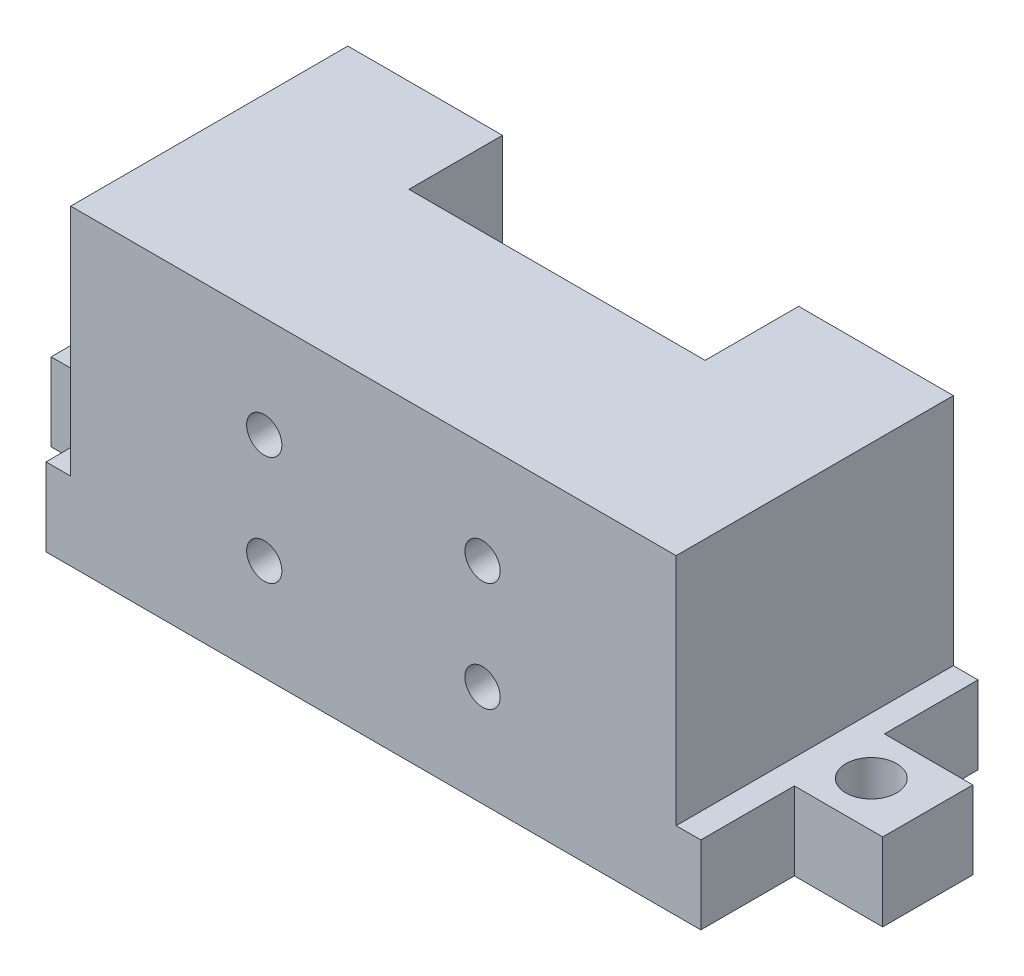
from build123d import *

# Parameters (mm, degrees)
SKETCH1_W           = 53.34
SKETCH1_H           = 17.78
BOSS_EXTRUDE2_DEPTH = 20
SKETCH3_W           = 5.67
SKETCH3_H           = 6
SKETCH3_W_2         = 5.667016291
CUT_EXTRUDE1_DEPTH  = 60.676494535
SKETCH4_R           = 1.629508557
SKETCH4_W           = 19
SKETCH4_H           = 6
CUT_EXTRUDE3_DEPTH  = 20
SKETCH5_W           = 7.253980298
SKETCH5_H           = 17.78
CUT_EXTRUDE4_DEPTH  = 15
SKETCH6_W           = 8.91
SKETCH6_H           = 17.78
CUT_EXTRUDE5_DEPTH  = 15
SKETCH7_R           = 1.63
CUT_EXTRUDE6_DEPTH  = 15
SKETCH8_R           = 1.13
CUT_EXTRUDE7_DEPTH  = 59.171505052


with BuildPart() as part:
    # Sketch1 → Boss-Extrude2 (new body)
    with BuildSketch(Plane(origin=(0, 0, 0), x_dir=(1, 0, 0), z_dir=(0, 1, 0))):
        with Locations((26.67, 8.89)):
            Rectangle(SKETCH1_W, SKETCH1_H)
    extrude(amount=BOSS_EXTRUDE2_DEPTH)

    # Sketch3 → Cut-Extrude1 (cut, through all)
    with BuildSketch(Plane(origin=(0, 20, 0), x_dir=(1, 0, 0), z_dir=(0, 1, 0))):
        with Locations((2.835, 3)):
            Rectangle(SKETCH3_W, SKETCH3_H)
        with Locations((2.835, 14.78)):
            Rectangle(SKETCH3_W, SKETCH3_H)
        with Locations((50.506491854, 14.78)):
            Rectangle(SKETCH3_W_2, SKETCH3_H)
        with Locations((50.506491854, 3)):
            Rectangle(SKETCH3_W_2, SKETCH3_H)
    extrude(amount=-CUT_EXTRUDE1_DEPTH, mode=Mode.SUBTRACT)

    # Sketch4 → Cut-Extrude3 (cut)
    with BuildSketch(Plane(origin=(0, 20, 0), x_dir=(1, 0, 0), z_dir=(0, 1, 0))):
        with Locations((-4.262578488, 26.719711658)):
            Circle(SKETCH4_R)
        with Locations((51.532121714, 23.140429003)):
            Circle(SKETCH4_R)
        with Locations((26.67, 14.78)):
            Rectangle(SKETCH4_W, SKETCH4_H)
    extrude(amount=-CUT_EXTRUDE3_DEPTH, mode=Mode.SUBTRACT)

    # Sketch5 → Cut-Extrude4 (cut)
    with BuildSketch(Plane(origin=(0, 20, 0), x_dir=(1, 0, 0), z_dir=(0, 1, 0))):
        with Locations((3.626990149, 8.89)):
            Rectangle(SKETCH5_W, SKETCH5_H)
    extrude(amount=-CUT_EXTRUDE4_DEPTH, mode=Mode.SUBTRACT)

    # Sketch6 → Cut-Extrude5 (cut)
    with BuildSketch(Plane(origin=(0, 20, 0), x_dir=(1, 0, 0), z_dir=(0, 1, 0))):
        with Locations((50.545, 8.89)):
            Rectangle(SKETCH6_W, SKETCH6_H)
    extrude(amount=-CUT_EXTRUDE5_DEPTH, mode=Mode.SUBTRACT)

    # Sketch7 → Cut-Extrude6 (cut)
    with BuildSketch(Plane(origin=(0, 5, 0), x_dir=(1, 0, 0), z_dir=(0, 1, 0))):
        with Locations(Location((3.625, 8.89, 0), (0, 0, 270))):
            Circle(SKETCH7_R)
        with Locations(Location((49.715, 8.89, 0), (0, 0, 270))):
            Circle(SKETCH7_R)
    extrude(amount=-CUT_EXTRUDE6_DEPTH, mode=Mode.SUBTRACT)

    # Sketch8 → Cut-Extrude7 (cut, through all)
    with BuildSketch(Plane(origin=(0, 0, -11.78), x_dir=(-1, 0, 0), z_dir=(0, 0, -1))):
        with Locations((-19.67, 13.5)):
            Circle(SKETCH8_R)
        with Locations((-19.67, 6.5)):
            Circle(SKETCH8_R)
        with Locations((-33.67, 13.5)):
            Circle(SKETCH8_R)
        with Locations((-33.67, 6.5)):
            Circle(SKETCH8_R)
    extrude(amount=-CUT_EXTRUDE7_DEPTH, mode=Mode.SUBTRACT)


solid = part.part
